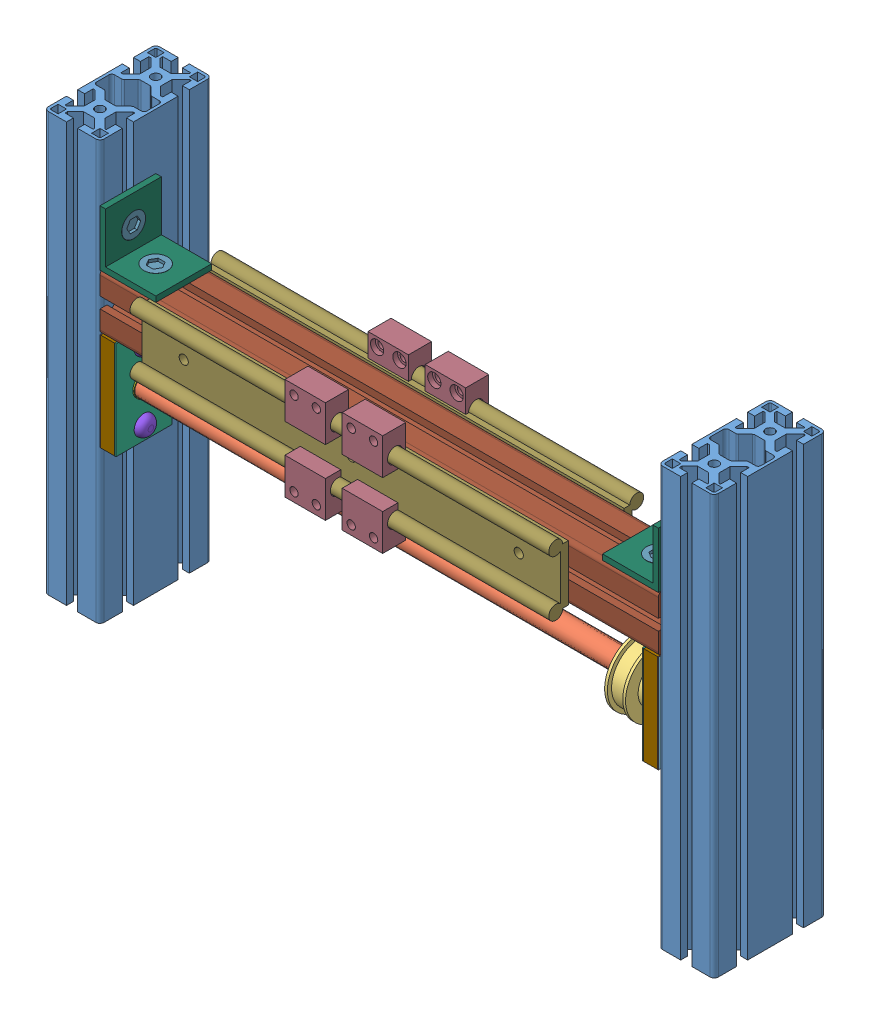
SolidWorks assembly Y-1-Base + Eje (sin tapas ni soporte Z) .SLDASM, configuration Predeterminado (file format 3800). Lengths in mm.
Overall size (480 300 98).
51 component instances, 16 part files, 0 mates.
Components (placement in the parent):
- Y-Pervil AL estructura 4x8x300-1: Y-Pervil AL estructura 4x8x300.SLDPRT [Predeterminado] at (260 100 -40) x (0 0 1) z (0 -1 0) size (80 40 300)
- Y-Pervil AL estructura 4x8x300-2: Y-Pervil AL estructura 4x8x300.SLDPRT [Predeterminado] at (-180 100 -40) x (0 0 1) z (0 -1 0) size (80 40 300)
- Y-Husillo con apollos y tureca-1: Y-Husillo con apollos y tureca.SLDASM [Predeterminado] at (-147.5 -55 0) x (0 1 0) z (1 0 0) size (70 62 417)
  - Y-Husillo con apollos-1: Y-Husillo con apollos.SLDASM [Predeterminado] at origin size (70 48 417)
    - Y-Husillo-1: Y-Husillo.SLDPRT [Predeterminado] at origin size (15 15 397)
    - Y-Polea (26 XL 037)-1: Y-Polea (26 XL 037).SLDPRT [Predeterminado] at (0 0 353) x (1 0 0) z (0 -1 0) size (48 22 48)
    - Y-Rodamiento completo-1: Y-Rodamiento completo.SLDASM [Predeterminado] at (0 0 -2) size (70 40 25)
      - Y-Apollo Soporte-1: Y-Apollo Soporte.SLDPRT [Predeterminado] at (0 0 -10) x (-1 0 0) z (0 0 -1) size (70 40 0.5)
      - Y-Protector completo fino-1: Y-Protector completo fino.SLDPRT [Predeterminado] at (0 0 -10.5) x (-1 0 0) z (0 0 -1) size (70 40 0.1)
      - Y-Protector con agujero-1: Y-Protector con agujero.SLDPRT [Predeterminado] at (0 0 1) x (-1 0 0) z (0 0 -1) size (70 40 1)
      - Y-Funda ()-1: Y-Funda ().SLDPRT [Predeterminado] at (0 0 2) x (-1 0 0) z (0 0 -1) size (16 16 10)
      - Y-Rodamiento con soporte y tornillo-1: Y-Rodamiento con soporte y tornillo.SLDASM [Predeterminado] at (0 0 0.5) size (70 40 25)
        - Y-Tornillo M8 x20-2: Y-Tornillo M8 x20.SLDPRT [Predeterminado] at (-25 0 5.5) x (-1 0 0) z (0 0 -1) size (14 14 25)
        - Y-Tornillo M8 x20-1: Y-Tornillo M8 x20.SLDPRT [Predeterminado] at (25 0 5.5) x (-1 0 0) z (0 0 -1) size (14 14 25)
        - Y-Rodamiento con soporte-1: Y-Rodamiento con soporte.SLDASM [Predeterminado] at (0 0 -10.5) size (70 40 10)
          - Y-Soporte rodamiento-1: Y-Soporte rodamiento.SLDPRT [Predeterminado] at origin size (70 40 10)
          - Y-Rodamiento (7201.2RS.TVP)-1: Y-Rodamiento (7201.2RS.TVP).SLDPRT [Predeterminado] at origin size (32 32 10)
    - Y-Rodamiento completo-2: Y-Rodamiento completo.SLDASM [Predeterminado] at (0 0 377) x (-1 0 0) z (0 0 -1) size (70 40 25)
      - Y-Apollo Soporte-1: Y-Apollo Soporte.SLDPRT [Predeterminado] at (0 0 -10) x (-1 0 0) z (0 0 -1) size (70 40 0.5)
      - Y-Protector completo fino-1: Y-Protector completo fino.SLDPRT [Predeterminado] at (0 0 -10.5) x (-1 0 0) z (0 0 -1) size (70 40 0.1)
      - Y-Protector con agujero-1: Y-Protector con agujero.SLDPRT [Predeterminado] at (0 0 1) x (-1 0 0) z (0 0 -1) size (70 40 1)
      - Y-Funda ()-1: Y-Funda ().SLDPRT [Predeterminado] at (0 0 2) x (-1 0 0) z (0 0 -1) size (16 16 10)
      - Y-Rodamiento con soporte y tornillo-1: Y-Rodamiento con soporte y tornillo.SLDASM [Predeterminado] at (0 0 0.5) size (70 40 25)
        - Y-Tornillo M8 x20-2: Y-Tornillo M8 x20.SLDPRT [Predeterminado] at (-25 0 5.5) x (-1 0 0) z (0 0 -1) size (14 14 25)
        - Y-Tornillo M8 x20-1: Y-Tornillo M8 x20.SLDPRT [Predeterminado] at (25 0 5.5) x (-1 0 0) z (0 0 -1) size (14 14 25)
        - Y-Rodamiento con soporte-1: Y-Rodamiento con soporte.SLDASM [Predeterminado] at (0 0 -10.5) size (70 40 10)
          - Y-Soporte rodamiento-1: Y-Soporte rodamiento.SLDPRT [Predeterminado] at origin size (70 40 10)
          - Y-Rodamiento (7201.2RS.TVP)-1: Y-Rodamiento (7201.2RS.TVP).SLDPRT [Predeterminado] at origin size (32 32 10)
  - Y-Turerca nylon-1: Y-Turerca nylon.SLDPRT [Predeterminado] at (0 20 173) x (1 0 0) z (0 -1 0) size (40 30 58)
- Y-Soprte deslizaderas-1: Y-Soprte deslizaderas.SLDASM [Predeterminado] at (175 0 0) x (0 0 -1) z (1 0 0) size (76 73 400)
  - Y-Pervil AL estructura 4x4x400-1: Y-Pervil AL estructura 4x4x400.SLDPRT [Predeterminado] at (0 0 65) x (0 1 0) z (0 0 -1) size (40 40 400)
  - Y-Deslizaderas con patines-1: Y-Deslizaderas con patines.SLDASM [Predeterminado] at (0 0 -299.5) x (1 0 0) z (0 0 -1) size (18 73 300)
    - Y-Deslizadera doble-1: Y-Deslizadera doble.SLDPRT [Predeterminado] at (-22.75 0 0) x (0 -1 0) z (0 0 -1) size (50 14 300)
    - Y-Patin-1: Y-Patin.SLDPRT [Predeterminado] at (-29.75 -23.5 -185) x (0 1 0) z (0 0 1) size (26 16.5 29)
    - Y-Patin-3: Y-Patin.SLDPRT [Predeterminado] at (-29.75 23.5 -156) x (0 -1 0) z (0 0 -1) size (26 16.5 29)
    - Y-Patin-4: Y-Patin.SLDPRT [Predeterminado] at (-29.75 23.5 -115) x (0 -1 0) z (0 0 -1) size (26 16.5 29)
    - Y-Patin-6: Y-Patin.SLDPRT [Predeterminado] at (-29.75 -23.5 -144) x (0 1 0) z (0 0 1) size (26 16.5 29)
  - Y-Deslizaderas con patines-2: Y-Deslizaderas con patines.SLDASM [Predeterminado] at (0 0 0.5) x (-1 0 0) z (0 0 1) size (18 73 300)
    - Y-Deslizadera doble-1: Y-Deslizadera doble.SLDPRT [Predeterminado] at (-22.75 0 0) x (0 -1 0) z (0 0 -1) size (50 14 300)
    - Y-Patin-1: Y-Patin.SLDPRT [Predeterminado] at (-29.75 -23.5 -185) x (0 1 0) z (0 0 1) size (26 16.5 29)
    - Y-Patin-3: Y-Patin.SLDPRT [Predeterminado] at (-29.75 23.5 -156) x (0 -1 0) z (0 0 -1) size (26 16.5 29)
    - Y-Patin-4: Y-Patin.SLDPRT [Predeterminado] at (-29.75 23.5 -115) x (0 -1 0) z (0 0 -1) size (26 16.5 29)
    - Y-Patin-6: Y-Patin.SLDPRT [Predeterminado] at (-29.75 -23.5 -144) x (0 1 0) z (0 0 1) size (26 16.5 29)
- Y-Angulo con tornillos-2: Y-Angulo con tornillos.SLDASM [Predeterminado] at (-160 20 -20) size (55.92 55.89 40)
  - Y-Tornillo M8 x16-1: Y-Tornillo M8 x16.SLDPRT [Predeterminado] at (19.9756 -15.8873 20.1118) size (17 20 17)
  - Y-Angulo 40x40 L (0.0.196.87)-1: Y-Angulo 40x40 L (0.0.196.87).SLDPRT [Predeterminado] at origin size (40 40 40)
  - Y-Tornillo M8 x16-2: Y-Tornillo M8 x16.SLDPRT [Predeterminado] at (-15.9177 20.1326 19.8969) x (0 0 1) z (0 1 0) size (17 20 17)
- Y-Angulo con tornillos-1: Y-Angulo con tornillos.SLDASM [Predeterminado] at (240 20 -20) x (0 1 0) z (0 0 1) size (55.92 55.89 40)
  - Y-Tornillo M8 x16-1: Y-Tornillo M8 x16.SLDPRT [Predeterminado] at (19.9756 -15.8873 20.1118) size (17 20 17)
  - Y-Angulo 40x40 L (0.0.196.87)-1: Y-Angulo 40x40 L (0.0.196.87).SLDPRT [Predeterminado] at origin size (40 40 40)
  - Y-Tornillo M8 x16-2: Y-Tornillo M8 x16.SLDPRT [Predeterminado] at (-15.9177 20.1326 19.8969) x (0 0 1) z (0 1 0) size (17 20 17)
